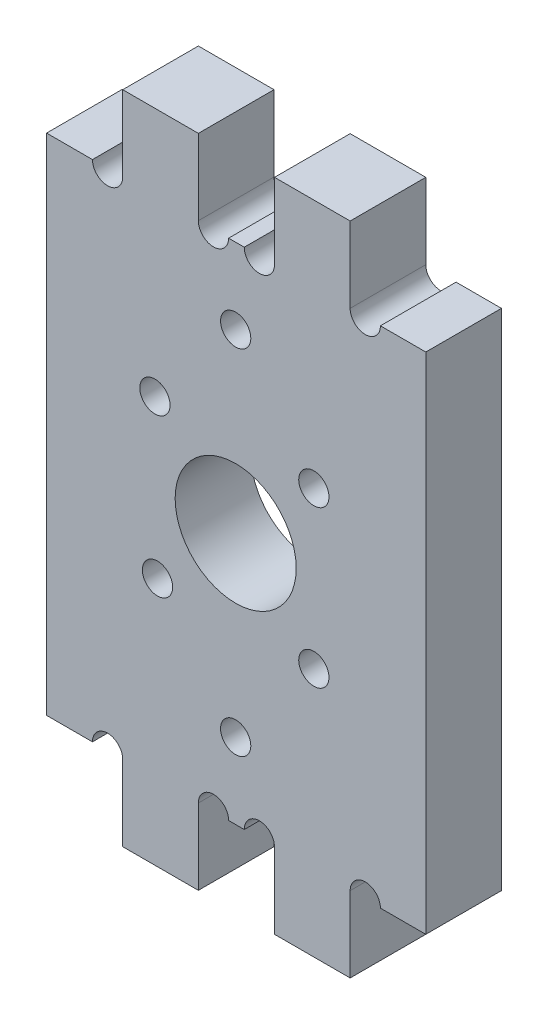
from build123d import *

# Parameters (mm, degrees)
AUFSATZ_LINEAR_AUSTRAGEN1_DEPTH = 15
SKIZZE2_R                       = 5.05
SCHNITT_LINEAR_AUSTRAGEN2_DEPTH = 7.5
SKIZZE3_R                       = 12
SKIZZE3_R_2                     = 3
SCHNITT_LINEAR_AUSTRAGEN3_DEPTH = 17.5


with BuildPart() as part:
    # Skizze1 → Aufsatz-Linear austragen1 (new body)
    with BuildSketch(Plane.XY):
        with BuildLine():
            Line((0, 0), (0, 100))
            Line((0, 100), (-9, 100))
            ThreePointArc((-9, 100), (-12, 97), (-15, 100))
            Line((-15, 100), (-15, 115))
            Line((-15, 115), (-30, 115))
            Line((-30, 115), (-30, 100))
            ThreePointArc((-30, 100), (-33, 97), (-36, 100))
            Line((-36, 100), (-39.1, 100))
            ThreePointArc((-39.1, 100), (-42.1, 97), (-45.1, 100))
            Line((-45.1, 100), (-45.1, 115))
            Line((-45.1, 115), (-60.1, 115))
            Line((-60.1, 115), (-60.1, 100))
            ThreePointArc((-60.1, 100), (-63.1, 97), (-66.1, 100))
            Line((-66.1, 100), (-75.2, 100))
            Line((-75.2, 100), (-75.2, 0))
            Line((-75.2, 0), (-66.1, 0))
            ThreePointArc((-66.1, 0), (-63.1, 3), (-60.1, 0))
            Line((-60.1, 0), (-60.1, -15))
            Line((-60.1, -15), (-45.1, -15))
            Line((-45.1, -15), (-45.1, 0))
            ThreePointArc((-45.1, 0), (-42.1, 3), (-39.1, 0))
            Line((-39.1, 0), (-36, 0))
            ThreePointArc((-36, 0), (-33, 3), (-30, 0))
            Line((-30, 0), (-30, -15))
            Line((-30, -15), (-15, -15))
            Line((-15, -15), (-15, 0))
            ThreePointArc((-15, 0), (-12, 3), (-9, 0))
            Line((-9, 0), (0, 0))
        make_face()
    extrude(amount=AUFSATZ_LINEAR_AUSTRAGEN1_DEPTH)

    # Skizze2 → Schnitt-Linear austragen2 (cut)
    with BuildSketch(Plane(origin=(0, 0, 0), x_dir=(-1, 0, 0), z_dir=(0, 0, -1))):
        with Locations((37.7, 85)):
            Circle(SKIZZE2_R)
        with Locations((37.7, 15)):
            Circle(SKIZZE2_R)
    extrude(amount=-SCHNITT_LINEAR_AUSTRAGEN2_DEPTH, mode=Mode.SUBTRACT)

    # Skizze3 → Schnitt-Linear austragen3 (cut)
    with BuildSketch(Plane(origin=(0, 0, 0), x_dir=(-1, 0, 0), z_dir=(0, 0, -1))):
        with Locations((37.7, 50)):
            Circle(SKIZZE3_R)
        with Locations((22.2, 34.5)):
            Circle(SKIZZE3_R_2)
        with Locations((22.2, 65.5)):
            Circle(SKIZZE3_R_2)
        with Locations((53.2, 34.5)):
            Circle(SKIZZE3_R_2)
        with Locations((53.711433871, 65.5)):
            Circle(SKIZZE3_R_2)
        with Locations((37.7, 85)):
            Circle(SKIZZE3_R_2)
        with Locations((37.7, 15)):
            Circle(SKIZZE3_R_2)
    extrude(amount=-SCHNITT_LINEAR_AUSTRAGEN3_DEPTH, mode=Mode.SUBTRACT)


solid = part.part
